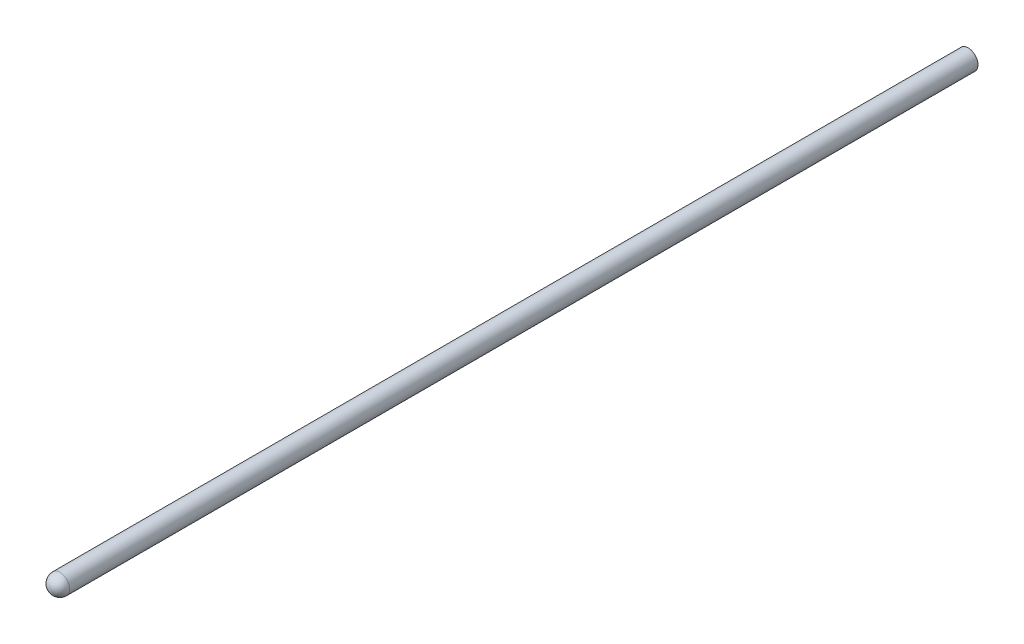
ISO-10303-21;
HEADER;
FILE_DESCRIPTION(('STEP AP214'),'2;1');
FILE_NAME('part.step','',(''),(''),'','','');
FILE_SCHEMA(('AUTOMOTIVE_DESIGN { 1 0 10303 214 1 1 1 1 }'));
ENDSEC;
DATA;
#1=APPLICATION_CONTEXT('core data for automotive mechanical design processes');
#2=APPLICATION_PROTOCOL_DEFINITION('international standard','automotive_design',2000,#1);
#3=PRODUCT_CONTEXT('',#1,'mechanical');
#4=PRODUCT('Part','Part','',(#3));
#5=PRODUCT_RELATED_PRODUCT_CATEGORY('part','',(#4));
#6=PRODUCT_DEFINITION_FORMATION('','',#4);
#7=PRODUCT_DEFINITION_CONTEXT('part definition',#1,'design');
#8=PRODUCT_DEFINITION('design','',#6,#7);
#9=PRODUCT_DEFINITION_SHAPE('','',#8);
#10=(LENGTH_UNIT() NAMED_UNIT(*) SI_UNIT(.MILLI.,.METRE.));
#11=(NAMED_UNIT(*) PLANE_ANGLE_UNIT() SI_UNIT($,.RADIAN.));
#12=(NAMED_UNIT(*) SI_UNIT($,.STERADIAN.) SOLID_ANGLE_UNIT());
#13=UNCERTAINTY_MEASURE_WITH_UNIT(LENGTH_MEASURE(1.E-05),#10,'distance_accuracy_value','');
#14=(GEOMETRIC_REPRESENTATION_CONTEXT(3) GLOBAL_UNCERTAINTY_ASSIGNED_CONTEXT((#13)) GLOBAL_UNIT_ASSIGNED_CONTEXT((#10,
#11,#12)) REPRESENTATION_CONTEXT('',''));
#15=CARTESIAN_POINT('',(0.,0.,0.));
#16=DIRECTION('',(0.,0.,1.));
#17=DIRECTION('',(1.,0.,0.));
#18=AXIS2_PLACEMENT_3D('',#15,#16,#17);
#19=CARTESIAN_POINT('',(0.,0.,0.));
#20=DIRECTION('',(0.,0.,-1.));
#21=DIRECTION('',(0.,1.,0.));
#22=AXIS2_PLACEMENT_3D('',#19,#20,#21);
#23=CYLINDRICAL_SURFACE('',#22,1.5);
#24=CARTESIAN_POINT('',(0.,0.,0.));
#25=DIRECTION('',(0.,0.,-1.));
#26=DIRECTION('',(0.,1.,0.));
#27=AXIS2_PLACEMENT_3D('',#24,#25,#26);
#28=CIRCLE('',#27,1.5);
#29=CARTESIAN_POINT('',(0.,1.5,0.));
#30=VERTEX_POINT('',#29);
#31=EDGE_CURVE('E11',#30,#30,#28,.T.);
#32=ORIENTED_EDGE('',*,*,#31,.F.);
#33=EDGE_LOOP('',(#32));
#34=FACE_BOUND('',#33,.T.);
#35=CARTESIAN_POINT('',(0.,0.,138.5));
#36=DIRECTION('',(0.,0.,1.));
#37=DIRECTION('',(0.,-1.,0.));
#38=AXIS2_PLACEMENT_3D('',#35,#36,#37);
#39=CIRCLE('',#38,1.50000000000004);
#40=CARTESIAN_POINT('',(0.,-1.50000000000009,138.5));
#41=VERTEX_POINT('',#40);
#42=EDGE_CURVE('E40',#41,#41,#39,.T.);
#43=ORIENTED_EDGE('',*,*,#42,.F.);
#44=EDGE_LOOP('',(#43));
#45=FACE_BOUND('',#44,.T.);
#46=ADVANCED_FACE('F33',(#34,#45),#23,.T.);
#47=CARTESIAN_POINT('',(0.,0.,0.));
#48=DIRECTION('',(0.,0.,-1.));
#49=DIRECTION('',(0.,1.,0.));
#50=AXIS2_PLACEMENT_3D('',#47,#48,#49);
#51=PLANE('',#50);
#52=ORIENTED_EDGE('',*,*,#31,.T.);
#53=EDGE_LOOP('',(#52));
#54=FACE_BOUND('',#53,.T.);
#55=ADVANCED_FACE('F35',(#54),#51,.T.);
#56=CARTESIAN_POINT('',(0.,0.,138.5));
#57=DIRECTION('',(0.,0.,1.));
#58=DIRECTION('',(0.,-1.,0.));
#59=AXIS2_PLACEMENT_3D('',#56,#57,#58);
#60=SPHERICAL_SURFACE('',#59,1.49999999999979);
#61=CARTESIAN_POINT('',(0.,0.,140.));
#62=VERTEX_POINT('',#61);
#63=VERTEX_LOOP('',#62);
#64=FACE_BOUND('',#63,.T.);
#65=ORIENTED_EDGE('',*,*,#42,.T.);
#66=EDGE_LOOP('',(#65));
#67=FACE_BOUND('',#66,.T.);
#68=ADVANCED_FACE('F43',(#64,#67),#60,.T.);
#69=CLOSED_SHELL('',(#46,#55,#68));
#70=MANIFOLD_SOLID_BREP('B2',#69);
#71=ADVANCED_BREP_SHAPE_REPRESENTATION('',(#18,#70),#14);
#72=SHAPE_DEFINITION_REPRESENTATION(#9,#71);
ENDSEC;
END-ISO-10303-21;
